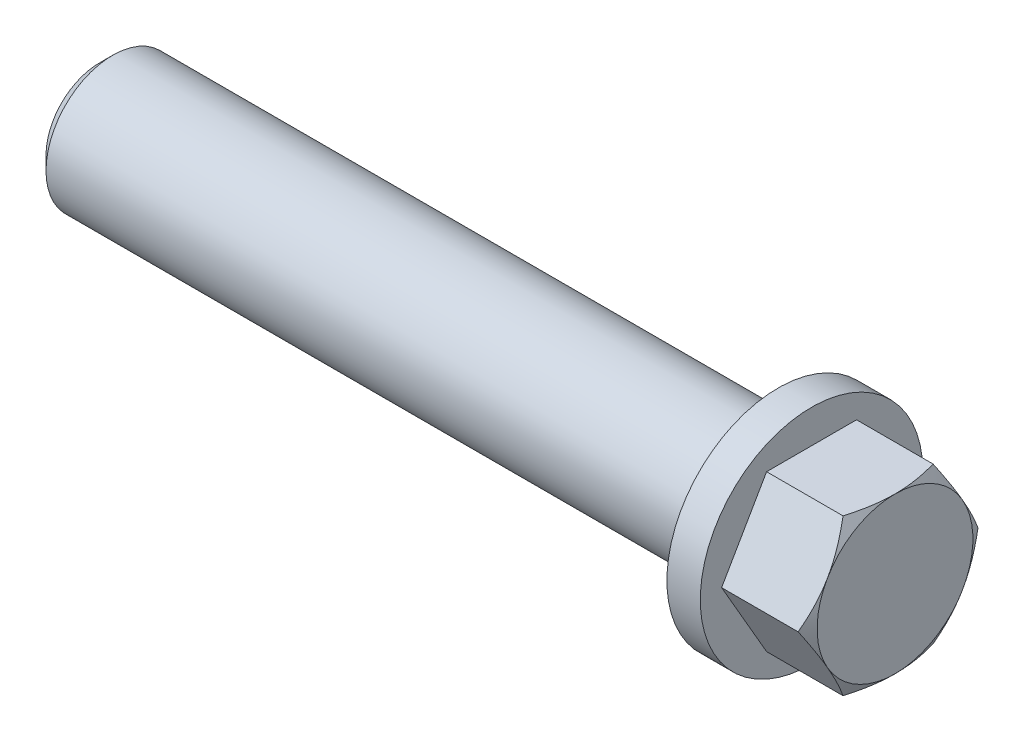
ISO-10303-21;
HEADER;
FILE_DESCRIPTION(('STEP AP214'),'2;1');
FILE_NAME('part.step','',(''),(''),'','','');
FILE_SCHEMA(('AUTOMOTIVE_DESIGN { 1 0 10303 214 1 1 1 1 }'));
ENDSEC;
DATA;
#1=APPLICATION_CONTEXT('core data for automotive mechanical design processes');
#2=APPLICATION_PROTOCOL_DEFINITION('international standard','automotive_design',2000,#1);
#3=PRODUCT_CONTEXT('',#1,'mechanical');
#4=PRODUCT('Part','Part','',(#3));
#5=PRODUCT_RELATED_PRODUCT_CATEGORY('part','',(#4));
#6=PRODUCT_DEFINITION_FORMATION('','',#4);
#7=PRODUCT_DEFINITION_CONTEXT('part definition',#1,'design');
#8=PRODUCT_DEFINITION('design','',#6,#7);
#9=PRODUCT_DEFINITION_SHAPE('','',#8);
#10=(LENGTH_UNIT() NAMED_UNIT(*) SI_UNIT(.MILLI.,.METRE.));
#11=(NAMED_UNIT(*) PLANE_ANGLE_UNIT() SI_UNIT($,.RADIAN.));
#12=(NAMED_UNIT(*) SI_UNIT($,.STERADIAN.) SOLID_ANGLE_UNIT());
#13=UNCERTAINTY_MEASURE_WITH_UNIT(LENGTH_MEASURE(1.E-05),#10,'distance_accuracy_value','');
#14=(GEOMETRIC_REPRESENTATION_CONTEXT(3) GLOBAL_UNCERTAINTY_ASSIGNED_CONTEXT((#13)) GLOBAL_UNIT_ASSIGNED_CONTEXT((#10,
#11,#12)) REPRESENTATION_CONTEXT('',''));
#15=CARTESIAN_POINT('',(0.,0.,0.));
#16=DIRECTION('',(0.,0.,1.));
#17=DIRECTION('',(1.,0.,0.));
#18=AXIS2_PLACEMENT_3D('',#15,#16,#17);
#19=CARTESIAN_POINT('',(7.5,-7.,-4.04145188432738));
#20=DIRECTION('',(0.,0.5,0.866025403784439));
#21=DIRECTION('',(0.,-0.866025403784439,0.5));
#22=AXIS2_PLACEMENT_3D('',#19,#20,#21);
#23=PLANE('',#22);
#24=DIRECTION('',(-1.,0.,0.));
#25=VECTOR('',#24,1.);
#26=CARTESIAN_POINT('',(7.5,0.,-8.08290376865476));
#27=LINE('',#26,#25);
#28=CARTESIAN_POINT('',(6.87478521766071,0.,-8.08290376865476));
#29=VERTEX_POINT('',#28);
#30=CARTESIAN_POINT('',(0.,0.,-8.08290376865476));
#31=VERTEX_POINT('',#30);
#32=EDGE_CURVE('E145',#29,#31,#27,.T.);
#33=ORIENTED_EDGE('',*,*,#32,.F.);
#34=CARTESIAN_POINT('',(6.8747185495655,0.0002,-8.0830192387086));
#35=CARTESIAN_POINT('',(6.92600015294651,-0.153667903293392,-7.99418356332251));
#36=CARTESIAN_POINT('',(6.97495440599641,-0.308109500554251,-7.90501666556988));
#37=CARTESIAN_POINT('',(7.06756721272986,-0.618246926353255,-7.72595873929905));
#38=CARTESIAN_POINT('',(7.11122348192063,-0.773943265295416,-7.63606741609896));
#39=CARTESIAN_POINT('',(7.2333884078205,-1.24352516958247,-7.36495417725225));
#40=CARTESIAN_POINT('',(7.30287444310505,-1.5592643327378,-7.18266208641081));
#41=CARTESIAN_POINT('',(7.3843550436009,-2.03176224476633,-6.9098652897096));
#42=CARTESIAN_POINT('',(7.40756651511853,-2.18710922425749,-6.82017566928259));
#43=CARTESIAN_POINT('',(7.44648878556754,-2.49850511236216,-6.64039116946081));
#44=CARTESIAN_POINT('',(7.46220024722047,-2.65455395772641,-6.55029632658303));
#45=CARTESIAN_POINT('',(7.48572208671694,-2.96692267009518,-6.36995016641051));
#46=CARTESIAN_POINT('',(7.49354143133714,-3.12324202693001,-6.27969914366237));
#47=CARTESIAN_POINT('',(7.50111975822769,-3.43601650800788,-6.09911871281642));
#48=CARTESIAN_POINT('',(7.50087898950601,-3.59247162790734,-6.00878930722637));
#49=CARTESIAN_POINT('',(7.4891402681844,-4.02110687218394,-5.76131663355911));
#50=CARTESIAN_POINT('',(7.46943425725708,-4.2931466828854,-5.60425437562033));
#51=CARTESIAN_POINT('',(7.40694653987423,-4.8354194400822,-5.29117305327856));
#52=CARTESIAN_POINT('',(7.36414347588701,-5.10565047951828,-5.13515508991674));
#53=CARTESIAN_POINT('',(7.25714832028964,-5.64901454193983,-4.82144370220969));
#54=CARTESIAN_POINT('',(7.19250290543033,-5.92207900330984,-4.66378986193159));
#55=CARTESIAN_POINT('',(7.04578392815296,-6.46413578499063,-4.35083323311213));
#56=CARTESIAN_POINT('',(6.96374482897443,-6.73313504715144,-4.19552643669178));
#57=CARTESIAN_POINT('',(6.8747185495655,-7.0002,-4.04133641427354));
#58=B_SPLINE_CURVE_WITH_KNOTS('',3,(#34,#35,#36,#37,#38,#39,#40,#41,#42,#43,#44,#45,#46,#47,#48,
#49,#50,#51,#52,#53,#54,#55,#56,#57),.UNSPECIFIED.,.F.,.F.,(4,2,2,2,2,2,2,2,2,2,2,4),(0.,
0.554727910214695,1.10969417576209,2.2219327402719,2.76443041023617,3.30688013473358,
3.8487128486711,4.39052882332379,5.33376515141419,6.27787517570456,7.2429241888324,
8.20607866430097),.UNSPECIFIED.);
#59=CARTESIAN_POINT('',(7.5,-3.5,-6.06217782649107));
#60=VERTEX_POINT('',#59);
#61=EDGE_CURVE('E228',#29,#60,#58,.T.);
#62=ORIENTED_EDGE('',*,*,#61,.T.);
#63=CARTESIAN_POINT('',(6.87478521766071,-7.,-4.04145188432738));
#64=VERTEX_POINT('',#63);
#65=EDGE_CURVE('E230',#60,#64,#58,.T.);
#66=ORIENTED_EDGE('',*,*,#65,.T.);
#67=DIRECTION('',(-1.,0.,0.));
#68=VECTOR('',#67,1.);
#69=CARTESIAN_POINT('',(7.5,-7.,-4.04145188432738));
#70=LINE('',#69,#68);
#71=CARTESIAN_POINT('',(0.,-7.,-4.04145188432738));
#72=VERTEX_POINT('',#71);
#73=EDGE_CURVE('E117',#64,#72,#70,.T.);
#74=ORIENTED_EDGE('',*,*,#73,.T.);
#75=DIRECTION('',(0.,0.866025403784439,-0.5));
#76=VECTOR('',#75,1.);
#77=CARTESIAN_POINT('',(0.,-7.,-4.04145188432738));
#78=LINE('',#77,#76);
#79=EDGE_CURVE('E113',#72,#31,#78,.T.);
#80=ORIENTED_EDGE('',*,*,#79,.T.);
#81=EDGE_LOOP('',(#33,#62,#66,#74,#80));
#82=FACE_BOUND('',#81,.T.);
#83=ADVANCED_FACE('F36',(#82),#23,.F.);
#84=CARTESIAN_POINT('',(7.5,0.,-8.08290376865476));
#85=DIRECTION('',(0.,-0.5,0.866025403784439));
#86=DIRECTION('',(0.,-0.866025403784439,-0.5));
#87=AXIS2_PLACEMENT_3D('',#84,#85,#86);
#88=PLANE('',#87);
#89=DIRECTION('',(-1.,0.,0.));
#90=VECTOR('',#89,1.);
#91=CARTESIAN_POINT('',(7.5,7.,-4.04145188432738));
#92=LINE('',#91,#90);
#93=CARTESIAN_POINT('',(6.87478521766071,7.,-4.04145188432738));
#94=VERTEX_POINT('',#93);
#95=CARTESIAN_POINT('',(0.,7.,-4.04145188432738));
#96=VERTEX_POINT('',#95);
#97=EDGE_CURVE('E142',#94,#96,#92,.T.);
#98=ORIENTED_EDGE('',*,*,#97,.F.);
#99=CARTESIAN_POINT('',(6.8747185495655,7.0002,-4.04133641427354));
#100=CARTESIAN_POINT('',(6.92600015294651,6.84633209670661,-4.13017208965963));
#101=CARTESIAN_POINT('',(6.97495440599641,6.69189049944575,-4.21933898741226));
#102=CARTESIAN_POINT('',(7.06756721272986,6.38175307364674,-4.39839691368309));
#103=CARTESIAN_POINT('',(7.11122348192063,6.22605673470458,-4.48828823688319));
#104=CARTESIAN_POINT('',(7.2333884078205,5.75647483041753,-4.75940147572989));
#105=CARTESIAN_POINT('',(7.30287444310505,5.4407356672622,-4.94169356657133));
#106=CARTESIAN_POINT('',(7.3843550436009,4.96823775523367,-5.21449036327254));
#107=CARTESIAN_POINT('',(7.40756651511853,4.81289077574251,-5.30417998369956));
#108=CARTESIAN_POINT('',(7.44648878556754,4.50149488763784,-5.48396448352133));
#109=CARTESIAN_POINT('',(7.46220024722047,4.34544604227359,-5.57405932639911));
#110=CARTESIAN_POINT('',(7.48572208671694,4.03307732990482,-5.75440548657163));
#111=CARTESIAN_POINT('',(7.49354143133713,3.87675797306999,-5.84465650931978));
#112=CARTESIAN_POINT('',(7.50111975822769,3.56398349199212,-6.02523694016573));
#113=CARTESIAN_POINT('',(7.50087898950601,3.40752837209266,-6.11556634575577));
#114=CARTESIAN_POINT('',(7.4891402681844,2.97889312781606,-6.36303901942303));
#115=CARTESIAN_POINT('',(7.46943425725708,2.7068533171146,-6.52010127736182));
#116=CARTESIAN_POINT('',(7.40694653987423,2.1645805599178,-6.83318259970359));
#117=CARTESIAN_POINT('',(7.36414347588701,1.89434952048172,-6.9892005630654));
#118=CARTESIAN_POINT('',(7.25714832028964,1.35098545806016,-7.30291195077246));
#119=CARTESIAN_POINT('',(7.19250290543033,1.07792099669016,-7.46056579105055));
#120=CARTESIAN_POINT('',(7.04578392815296,0.535864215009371,-7.77352241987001));
#121=CARTESIAN_POINT('',(6.96374482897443,0.26686495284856,-7.92882921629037));
#122=CARTESIAN_POINT('',(6.8747185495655,-0.000200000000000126,-8.0830192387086));
#123=B_SPLINE_CURVE_WITH_KNOTS('',3,(#99,#100,#101,#102,#103,#104,#105,#106,#107,#108,#109,#110,
#111,#112,#113,#114,#115,#116,#117,#118,#119,#120,#121,#122),.UNSPECIFIED.,.F.,.F.,(4,2,2,2,2,2,
2,2,2,2,2,4),(0.,0.554727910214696,1.10969417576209,2.2219327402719,2.76443041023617,
3.30688013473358,3.8487128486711,4.39052882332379,5.33376515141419,6.27787517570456,
7.2429241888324,8.20607866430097),.UNSPECIFIED.);
#124=CARTESIAN_POINT('',(7.5,3.5,-6.06217782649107));
#125=VERTEX_POINT('',#124);
#126=EDGE_CURVE('E219',#94,#125,#123,.T.);
#127=ORIENTED_EDGE('',*,*,#126,.T.);
#128=EDGE_CURVE('E193',#125,#29,#123,.T.);
#129=ORIENTED_EDGE('',*,*,#128,.T.);
#130=ORIENTED_EDGE('',*,*,#32,.T.);
#131=DIRECTION('',(0.,0.866025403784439,0.5));
#132=VECTOR('',#131,1.);
#133=CARTESIAN_POINT('',(0.,0.,-8.08290376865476));
#134=LINE('',#133,#132);
#135=EDGE_CURVE('E184',#31,#96,#134,.T.);
#136=ORIENTED_EDGE('',*,*,#135,.T.);
#137=EDGE_LOOP('',(#98,#127,#129,#130,#136));
#138=FACE_BOUND('',#137,.T.);
#139=ADVANCED_FACE('F207',(#138),#88,.F.);
#140=CARTESIAN_POINT('',(7.5,7.,-4.04145188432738));
#141=DIRECTION('',(0.,-1.,0.));
#142=DIRECTION('',(0.,0.,-1.));
#143=AXIS2_PLACEMENT_3D('',#140,#141,#142);
#144=PLANE('',#143);
#145=DIRECTION('',(-1.,0.,0.));
#146=VECTOR('',#145,1.);
#147=CARTESIAN_POINT('',(7.5,6.99999999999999,4.04145188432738));
#148=LINE('',#147,#146);
#149=CARTESIAN_POINT('',(6.87478521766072,6.99999999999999,4.04145188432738));
#150=VERTEX_POINT('',#149);
#151=CARTESIAN_POINT('',(0.,6.99999999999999,4.04145188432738));
#152=VERTEX_POINT('',#151);
#153=EDGE_CURVE('E139',#150,#152,#148,.T.);
#154=ORIENTED_EDGE('',*,*,#153,.F.);
#155=CARTESIAN_POINT('',(4.06584479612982,7.00000000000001,-10.8928464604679));
#156=CARTESIAN_POINT('',(4.21450026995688,7.00000000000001,-10.5867029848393));
#157=CARTESIAN_POINT('',(4.36174066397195,7.,-10.2798605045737));
#158=CARTESIAN_POINT('',(4.65259582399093,7.,-9.66440574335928));
#159=CARTESIAN_POINT('',(4.79621002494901,7.,-9.35579319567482));
#160=CARTESIAN_POINT('',(5.07973140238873,7.,-8.73485529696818));
#161=CARTESIAN_POINT('',(5.21961447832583,7.,-8.4225189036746));
#162=CARTESIAN_POINT('',(5.49370236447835,7.,-7.7953737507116));
#163=CARTESIAN_POINT('',(5.62790744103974,7.,-7.48056510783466));
#164=CARTESIAN_POINT('',(5.89331373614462,7.,-6.8378693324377));
#165=CARTESIAN_POINT('',(6.0242822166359,7.,-6.50988555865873));
#166=CARTESIAN_POINT('',(6.27639631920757,7.,-5.85009595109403));
#167=CARTESIAN_POINT('',(6.39754084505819,7.,-5.51828969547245));
#168=CARTESIAN_POINT('',(6.62685500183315,7.,-4.85093135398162));
#169=CARTESIAN_POINT('',(6.73505052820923,7.,-4.51538826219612));
#170=CARTESIAN_POINT('',(6.93502168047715,7.,-3.83950215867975));
#171=CARTESIAN_POINT('',(7.02680243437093,7.,-3.49916068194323));
#172=CARTESIAN_POINT('',(7.1890943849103,7.,-2.81522305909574));
#173=CARTESIAN_POINT('',(7.25971625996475,7.,-2.47165390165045));
#174=CARTESIAN_POINT('',(7.34671847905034,7.,-1.95314285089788));
#175=CARTESIAN_POINT('',(7.37256524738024,7.,-1.77976757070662));
#176=CARTESIAN_POINT('',(7.41744250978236,7.,-1.43214350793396));
#177=CARTESIAN_POINT('',(7.436473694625,7.,-1.25789481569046));
#178=CARTESIAN_POINT('',(7.467100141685,7.,-0.911049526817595));
#179=CARTESIAN_POINT('',(7.47878980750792,7.,-0.738461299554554));
#180=CARTESIAN_POINT('',(7.49485833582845,7.,-0.392945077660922));
#181=CARTESIAN_POINT('',(7.49923732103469,7.,-0.220017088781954));
#182=CARTESIAN_POINT('',(7.50057992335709,7.,0.125872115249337));
#183=CARTESIAN_POINT('',(7.49754340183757,7.,0.2988333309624));
#184=CARTESIAN_POINT('',(7.48412945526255,7.,0.644473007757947));
#185=CARTESIAN_POINT('',(7.47375167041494,7.,0.817151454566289));
#186=CARTESIAN_POINT('',(7.44031338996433,7.,1.23087218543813));
#187=CARTESIAN_POINT('',(7.41384108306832,7.,1.47164462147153));
#188=CARTESIAN_POINT('',(7.34805815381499,7.,1.9514167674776));
#189=CARTESIAN_POINT('',(7.30874582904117,6.99999999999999,2.19041623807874));
#190=CARTESIAN_POINT('',(7.17363274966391,6.99999999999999,2.90445905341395));
#191=CARTESIAN_POINT('',(7.06067846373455,6.99999999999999,3.37630026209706));
#192=CARTESIAN_POINT('',(6.86454385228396,6.99999999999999,4.0821986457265));
#193=CARTESIAN_POINT('',(6.79374157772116,6.99999999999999,4.31990513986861));
#194=CARTESIAN_POINT('',(6.64473048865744,6.99999999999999,4.7930081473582));
#195=CARTESIAN_POINT('',(6.5665216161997,6.99999999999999,5.02840464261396));
#196=CARTESIAN_POINT('',(6.40395697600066,6.99999999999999,5.49696607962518));
#197=CARTESIAN_POINT('',(6.31960307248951,6.99999999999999,5.73013167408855));
#198=CARTESIAN_POINT('',(6.14574648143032,6.99999999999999,6.19452230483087));
#199=CARTESIAN_POINT('',(6.05624392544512,6.99999999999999,6.42574739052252));
#200=CARTESIAN_POINT('',(5.79939160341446,6.99999999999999,7.0713958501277));
#201=CARTESIAN_POINT('',(5.62721890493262,6.99999999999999,7.4838990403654));
#202=CARTESIAN_POINT('',(5.272711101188,6.99999999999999,8.30453182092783));
#203=CARTESIAN_POINT('',(5.09037475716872,6.99999999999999,8.71266087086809));
#204=CARTESIAN_POINT('',(4.71806030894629,6.99999999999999,9.52561092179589));
#205=CARTESIAN_POINT('',(4.52807907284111,6.99999999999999,9.93043048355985));
#206=CARTESIAN_POINT('',(4.14238756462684,6.99999999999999,10.7372987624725));
#207=CARTESIAN_POINT('',(3.94667755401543,6.99999999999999,11.1393476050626));
#208=CARTESIAN_POINT('',(3.55049419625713,6.99999999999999,11.9419246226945));
#209=CARTESIAN_POINT('',(3.35001341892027,6.99999999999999,12.3424491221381));
#210=CARTESIAN_POINT('',(2.94555879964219,6.99999999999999,13.1417322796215));
#211=CARTESIAN_POINT('',(2.7415849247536,6.99999999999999,13.540490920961));
#212=CARTESIAN_POINT('',(2.33090289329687,6.99999999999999,14.3364753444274));
#213=CARTESIAN_POINT('',(2.1241954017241,6.99999999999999,14.7337014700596));
#214=CARTESIAN_POINT('',(1.70852695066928,6.99999999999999,15.526973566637));
#215=CARTESIAN_POINT('',(1.4995659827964,6.99999999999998,15.9230195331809));
#216=CARTESIAN_POINT('',(0.916803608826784,6.99999999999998,17.0213557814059));
#217=CARTESIAN_POINT('',(0.541023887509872,6.99999999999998,17.7225961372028));
#218=CARTESIAN_POINT('',(-0.214721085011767,6.99999999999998,19.1228739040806));
#219=CARTESIAN_POINT('',(-0.594686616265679,6.99999999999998,19.821911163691));
#220=CARTESIAN_POINT('',(-1.35641145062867,6.99999999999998,21.2159219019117));
#221=CARTESIAN_POINT('',(-1.73816026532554,6.99999999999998,21.9109011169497));
#222=CARTESIAN_POINT('',(-2.50401122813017,6.99999999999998,23.2994872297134));
#223=CARTESIAN_POINT('',(-2.8881131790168,6.99999999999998,23.9930942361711));
#224=CARTESIAN_POINT('',(-3.27306517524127,6.99999999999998,24.6862258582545));
#225=B_SPLINE_CURVE_WITH_KNOTS('',3,(#155,#156,#157,#158,#159,#160,#161,#162,#163,#164,#165,
#166,#167,#168,#169,#170,#171,#172,#173,#174,#175,#176,#177,#178,#179,#180,#181,#182,#183,#184,
#185,#186,#187,#188,#189,#190,#191,#192,#193,#194,#195,#196,#197,#198,#199,#200,#201,#202,#203,
#204,#205,#206,#207,#208,#209,#210,#211,#212,#213,#214,#215,#216,#217,#218,#219,#220,#221,#222,
#223,#224),.UNSPECIFIED.,.F.,.F.,(4,2,2,2,2,2,2,2,2,2,2,2,2,2,2,2,2,2,2,2,2,2,2,2,2,2,2,2,2,2,2,
2,2,2,4),(0.,1.02099246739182,2.04214305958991,3.06878742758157,4.09538358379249,
5.15475890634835,6.21425227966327,7.27159015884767,8.32859714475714,9.37997449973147,
9.90573557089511,10.4314433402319,10.9502447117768,11.469037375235,11.9878397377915,
12.5066675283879,13.2329284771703,13.9592857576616,15.4127396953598,16.1567571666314,
16.9007804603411,17.6445789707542,18.3883584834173,19.7291255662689,21.070056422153,
22.4115423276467,23.7529670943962,25.0966389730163,26.4403235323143,27.7836870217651,
29.1270555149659,31.5137750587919,33.9006552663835,36.2794216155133,38.6579912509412),.UNSPECIFIED.);
#226=CARTESIAN_POINT('',(7.5,7.,0.));
#227=VERTEX_POINT('',#226);
#228=EDGE_CURVE('E176',#150,#227,#225,.F.);
#229=ORIENTED_EDGE('',*,*,#228,.T.);
#230=EDGE_CURVE('E178',#227,#94,#225,.F.);
#231=ORIENTED_EDGE('',*,*,#230,.T.);
#232=ORIENTED_EDGE('',*,*,#97,.T.);
#233=DIRECTION('',(0.,0.,1.));
#234=VECTOR('',#233,1.);
#235=CARTESIAN_POINT('',(0.,7.,-4.04145188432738));
#236=LINE('',#235,#234);
#237=EDGE_CURVE('E133',#96,#152,#236,.T.);
#238=ORIENTED_EDGE('',*,*,#237,.T.);
#239=EDGE_LOOP('',(#154,#229,#231,#232,#238));
#240=FACE_BOUND('',#239,.T.);
#241=ADVANCED_FACE('F177',(#240),#144,.F.);
#242=CARTESIAN_POINT('',(7.5,6.99999999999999,4.04145188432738));
#243=DIRECTION('',(0.,-0.5,-0.866025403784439));
#244=DIRECTION('',(0.,0.866025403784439,-0.5));
#245=AXIS2_PLACEMENT_3D('',#242,#243,#244);
#246=PLANE('',#245);
#247=DIRECTION('',(-1.,0.,0.));
#248=VECTOR('',#247,1.);
#249=CARTESIAN_POINT('',(7.5,0.,8.08290376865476));
#250=LINE('',#249,#248);
#251=CARTESIAN_POINT('',(6.87478521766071,0.,8.08290376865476));
#252=VERTEX_POINT('',#251);
#253=CARTESIAN_POINT('',(0.,0.,8.08290376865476));
#254=VERTEX_POINT('',#253);
#255=EDGE_CURVE('E125',#252,#254,#250,.T.);
#256=ORIENTED_EDGE('',*,*,#255,.F.);
#257=CARTESIAN_POINT('',(6.8747185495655,-0.000200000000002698,8.0830192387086));
#258=CARTESIAN_POINT('',(6.92600015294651,0.153667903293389,7.99418356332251));
#259=CARTESIAN_POINT('',(6.97495440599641,0.308109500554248,7.90501666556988));
#260=CARTESIAN_POINT('',(7.06756721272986,0.618246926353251,7.72595873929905));
#261=CARTESIAN_POINT('',(7.11122348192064,0.773943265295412,7.63606741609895));
#262=CARTESIAN_POINT('',(7.23338840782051,1.24352516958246,7.36495417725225));
#263=CARTESIAN_POINT('',(7.30287444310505,1.5592643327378,7.18266208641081));
#264=CARTESIAN_POINT('',(7.3843550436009,2.03176224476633,6.9098652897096));
#265=CARTESIAN_POINT('',(7.40756651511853,2.18710922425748,6.82017566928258));
#266=CARTESIAN_POINT('',(7.44648878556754,2.49850511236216,6.64039116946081));
#267=CARTESIAN_POINT('',(7.46220024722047,2.65455395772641,6.55029632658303));
#268=CARTESIAN_POINT('',(7.48572208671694,2.96692267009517,6.36995016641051));
#269=CARTESIAN_POINT('',(7.49354143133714,3.12324202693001,6.27969914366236));
#270=CARTESIAN_POINT('',(7.5011197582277,3.43601650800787,6.09911871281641));
#271=CARTESIAN_POINT('',(7.50087898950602,3.59247162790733,6.00878930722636));
#272=CARTESIAN_POINT('',(7.4891402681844,4.02110687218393,5.76131663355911));
#273=CARTESIAN_POINT('',(7.46943425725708,4.2931466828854,5.60425437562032));
#274=CARTESIAN_POINT('',(7.40694653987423,4.83541944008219,5.29117305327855));
#275=CARTESIAN_POINT('',(7.36414347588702,5.10565047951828,5.13515508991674));
#276=CARTESIAN_POINT('',(7.25714832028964,5.64901454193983,4.82144370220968));
#277=CARTESIAN_POINT('',(7.19250290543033,5.92207900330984,4.66378986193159));
#278=CARTESIAN_POINT('',(7.04578392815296,6.46413578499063,4.35083323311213));
#279=CARTESIAN_POINT('',(6.96374482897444,6.73313504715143,4.19552643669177));
#280=CARTESIAN_POINT('',(6.8747185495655,7.00019999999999,4.04133641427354));
#281=B_SPLINE_CURVE_WITH_KNOTS('',3,(#257,#258,#259,#260,#261,#262,#263,#264,#265,#266,#267,
#268,#269,#270,#271,#272,#273,#274,#275,#276,#277,#278,#279,#280),.UNSPECIFIED.,.F.,.F.,(4,2,2,
2,2,2,2,2,2,2,2,4),(0.,0.554727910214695,1.10969417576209,2.2219327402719,2.76443041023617,
3.30688013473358,3.8487128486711,4.39052882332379,5.33376515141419,6.27787517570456,
7.2429241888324,8.20607866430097),.UNSPECIFIED.);
#282=CARTESIAN_POINT('',(7.5,3.5,6.06217782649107));
#283=VERTEX_POINT('',#282);
#284=EDGE_CURVE('E221',#252,#283,#281,.T.);
#285=ORIENTED_EDGE('',*,*,#284,.T.);
#286=EDGE_CURVE('E186',#283,#150,#281,.T.);
#287=ORIENTED_EDGE('',*,*,#286,.T.);
#288=ORIENTED_EDGE('',*,*,#153,.T.);
#289=DIRECTION('',(0.,-0.866025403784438,0.5));
#290=VECTOR('',#289,1.);
#291=CARTESIAN_POINT('',(0.,6.99999999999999,4.04145188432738));
#292=LINE('',#291,#290);
#293=EDGE_CURVE('E131',#152,#254,#292,.T.);
#294=ORIENTED_EDGE('',*,*,#293,.T.);
#295=EDGE_LOOP('',(#256,#285,#287,#288,#294));
#296=FACE_BOUND('',#295,.T.);
#297=ADVANCED_FACE('F206',(#296),#246,.F.);
#298=CARTESIAN_POINT('',(7.5,0.,8.08290376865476));
#299=DIRECTION('',(0.,0.5,-0.866025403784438));
#300=DIRECTION('',(0.,0.866025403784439,0.5));
#301=AXIS2_PLACEMENT_3D('',#298,#299,#300);
#302=PLANE('',#301);
#303=DIRECTION('',(-1.,0.,0.));
#304=VECTOR('',#303,1.);
#305=CARTESIAN_POINT('',(7.5,-7.,4.04145188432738));
#306=LINE('',#305,#304);
#307=CARTESIAN_POINT('',(6.87478521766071,-7.,4.04145188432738));
#308=VERTEX_POINT('',#307);
#309=CARTESIAN_POINT('',(0.,-7.,4.04145188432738));
#310=VERTEX_POINT('',#309);
#311=EDGE_CURVE('E120',#308,#310,#306,.T.);
#312=ORIENTED_EDGE('',*,*,#311,.F.);
#313=CARTESIAN_POINT('',(6.8747185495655,-7.0002,4.04133641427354));
#314=CARTESIAN_POINT('',(6.92600015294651,-6.84633209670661,4.13017208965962));
#315=CARTESIAN_POINT('',(6.97495440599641,-6.69189049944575,4.21933898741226));
#316=CARTESIAN_POINT('',(7.06756721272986,-6.38175307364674,4.39839691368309));
#317=CARTESIAN_POINT('',(7.11122348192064,-6.22605673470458,4.48828823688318));
#318=CARTESIAN_POINT('',(7.2333884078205,-5.75647483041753,4.75940147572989));
#319=CARTESIAN_POINT('',(7.30287444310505,-5.4407356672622,4.94169356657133));
#320=CARTESIAN_POINT('',(7.3843550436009,-4.96823775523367,5.21449036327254));
#321=CARTESIAN_POINT('',(7.40756651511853,-4.81289077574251,5.30417998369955));
#322=CARTESIAN_POINT('',(7.44648878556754,-4.50149488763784,5.48396448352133));
#323=CARTESIAN_POINT('',(7.46220024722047,-4.34544604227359,5.57405932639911));
#324=CARTESIAN_POINT('',(7.48572208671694,-4.03307732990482,5.75440548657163));
#325=CARTESIAN_POINT('',(7.49354143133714,-3.87675797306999,5.84465650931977));
#326=CARTESIAN_POINT('',(7.50111975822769,-3.56398349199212,6.02523694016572));
#327=CARTESIAN_POINT('',(7.50087898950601,-3.40752837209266,6.11556634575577));
#328=CARTESIAN_POINT('',(7.4891402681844,-2.97889312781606,6.36303901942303));
#329=CARTESIAN_POINT('',(7.46943425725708,-2.7068533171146,6.52010127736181));
#330=CARTESIAN_POINT('',(7.40694653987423,-2.1645805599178,6.83318259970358));
#331=CARTESIAN_POINT('',(7.36414347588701,-1.89434952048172,6.9892005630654));
#332=CARTESIAN_POINT('',(7.25714832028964,-1.35098545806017,7.30291195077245));
#333=CARTESIAN_POINT('',(7.19250290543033,-1.07792099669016,7.46056579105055));
#334=CARTESIAN_POINT('',(7.04578392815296,-0.535864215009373,7.77352241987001));
#335=CARTESIAN_POINT('',(6.96374482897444,-0.266864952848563,7.92882921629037));
#336=CARTESIAN_POINT('',(6.8747185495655,0.000199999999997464,8.0830192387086));
#337=B_SPLINE_CURVE_WITH_KNOTS('',3,(#313,#314,#315,#316,#317,#318,#319,#320,#321,#322,#323,
#324,#325,#326,#327,#328,#329,#330,#331,#332,#333,#334,#335,#336),.UNSPECIFIED.,.F.,.F.,(4,2,2,
2,2,2,2,2,2,2,2,4),(0.,0.554727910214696,1.10969417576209,2.2219327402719,2.76443041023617,
3.30688013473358,3.8487128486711,4.39052882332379,5.33376515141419,6.27787517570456,
7.2429241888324,8.20607866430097),.UNSPECIFIED.);
#338=CARTESIAN_POINT('',(7.5,-3.5,6.06217782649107));
#339=VERTEX_POINT('',#338);
#340=EDGE_CURVE('E56',#308,#339,#337,.T.);
#341=ORIENTED_EDGE('',*,*,#340,.T.);
#342=EDGE_CURVE('E227',#339,#252,#337,.T.);
#343=ORIENTED_EDGE('',*,*,#342,.T.);
#344=ORIENTED_EDGE('',*,*,#255,.T.);
#345=DIRECTION('',(0.,-0.866025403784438,-0.5));
#346=VECTOR('',#345,1.);
#347=CARTESIAN_POINT('',(0.,0.,8.08290376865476));
#348=LINE('',#347,#346);
#349=EDGE_CURVE('E110',#254,#310,#348,.T.);
#350=ORIENTED_EDGE('',*,*,#349,.T.);
#351=EDGE_LOOP('',(#312,#341,#343,#344,#350));
#352=FACE_BOUND('',#351,.T.);
#353=ADVANCED_FACE('F127',(#352),#302,.F.);
#354=CARTESIAN_POINT('',(7.5,-7.,4.04145188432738));
#355=DIRECTION('',(0.,1.,0.));
#356=DIRECTION('',(0.,0.,1.));
#357=AXIS2_PLACEMENT_3D('',#354,#355,#356);
#358=PLANE('',#357);
#359=ORIENTED_EDGE('',*,*,#73,.F.);
#360=CARTESIAN_POINT('',(4.06584479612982,-7.,-10.8928464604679));
#361=CARTESIAN_POINT('',(4.21450026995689,-7.,-10.5867029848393));
#362=CARTESIAN_POINT('',(4.36174066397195,-7.,-10.2798605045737));
#363=CARTESIAN_POINT('',(4.65259582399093,-7.,-9.66440574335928));
#364=CARTESIAN_POINT('',(4.79621002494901,-7.,-9.35579319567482));
#365=CARTESIAN_POINT('',(5.07973140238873,-7.,-8.73485529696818));
#366=CARTESIAN_POINT('',(5.21961447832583,-7.,-8.4225189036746));
#367=CARTESIAN_POINT('',(5.49370236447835,-7.,-7.7953737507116));
#368=CARTESIAN_POINT('',(5.62790744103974,-7.,-7.48056510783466));
#369=CARTESIAN_POINT('',(5.89331373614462,-7.,-6.8378693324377));
#370=CARTESIAN_POINT('',(6.0242822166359,-7.,-6.50988555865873));
#371=CARTESIAN_POINT('',(6.27639631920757,-7.,-5.85009595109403));
#372=CARTESIAN_POINT('',(6.39754084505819,-7.,-5.51828969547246));
#373=CARTESIAN_POINT('',(6.62685500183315,-7.,-4.85093135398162));
#374=CARTESIAN_POINT('',(6.73505052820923,-7.,-4.51538826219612));
#375=CARTESIAN_POINT('',(6.93502168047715,-7.,-3.83950215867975));
#376=CARTESIAN_POINT('',(7.02680243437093,-7.,-3.49916068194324));
#377=CARTESIAN_POINT('',(7.1890943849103,-7.,-2.81522305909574));
#378=CARTESIAN_POINT('',(7.25971625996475,-7.,-2.47165390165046));
#379=CARTESIAN_POINT('',(7.34671847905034,-7.,-1.95314285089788));
#380=CARTESIAN_POINT('',(7.37256524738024,-7.,-1.77976757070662));
#381=CARTESIAN_POINT('',(7.41744250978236,-7.,-1.43214350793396));
#382=CARTESIAN_POINT('',(7.436473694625,-7.,-1.25789481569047));
#383=CARTESIAN_POINT('',(7.467100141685,-7.,-0.911049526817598));
#384=CARTESIAN_POINT('',(7.47878980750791,-7.,-0.738461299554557));
#385=CARTESIAN_POINT('',(7.49485833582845,-7.,-0.392945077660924));
#386=CARTESIAN_POINT('',(7.49923732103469,-7.,-0.220017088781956));
#387=CARTESIAN_POINT('',(7.50057992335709,-7.,0.125872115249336));
#388=CARTESIAN_POINT('',(7.49754340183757,-7.,0.2988333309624));
#389=CARTESIAN_POINT('',(7.48412945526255,-7.,0.644473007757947));
#390=CARTESIAN_POINT('',(7.47375167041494,-7.,0.81715145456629));
#391=CARTESIAN_POINT('',(7.44031338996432,-7.,1.23087218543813));
#392=CARTESIAN_POINT('',(7.41384108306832,-7.,1.47164462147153));
#393=CARTESIAN_POINT('',(7.34805815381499,-7.,1.9514167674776));
#394=CARTESIAN_POINT('',(7.30874582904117,-7.,2.19041623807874));
#395=CARTESIAN_POINT('',(7.17363274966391,-7.,2.90445905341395));
#396=CARTESIAN_POINT('',(7.06067846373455,-7.,3.37630026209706));
#397=CARTESIAN_POINT('',(6.86454385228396,-7.,4.0821986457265));
#398=CARTESIAN_POINT('',(6.79374157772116,-7.,4.31990513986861));
#399=CARTESIAN_POINT('',(6.64473048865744,-7.,4.7930081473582));
#400=CARTESIAN_POINT('',(6.56652161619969,-7.,5.02840464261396));
#401=CARTESIAN_POINT('',(6.40395697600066,-7.,5.49696607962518));
#402=CARTESIAN_POINT('',(6.3196030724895,-7.,5.73013167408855));
#403=CARTESIAN_POINT('',(6.14574648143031,-7.,6.19452230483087));
#404=CARTESIAN_POINT('',(6.05624392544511,-7.,6.42574739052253));
#405=CARTESIAN_POINT('',(5.79939160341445,-7.,7.07139585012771));
#406=CARTESIAN_POINT('',(5.62721890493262,-7.,7.4838990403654));
#407=CARTESIAN_POINT('',(5.27271110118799,-7.,8.30453182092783));
#408=CARTESIAN_POINT('',(5.09037475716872,-7.,8.71266087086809));
#409=CARTESIAN_POINT('',(4.71806030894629,-7.,9.52561092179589));
#410=CARTESIAN_POINT('',(4.5280790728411,-7.,9.93043048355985));
#411=CARTESIAN_POINT('',(4.14238756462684,-7.,10.7372987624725));
#412=CARTESIAN_POINT('',(3.94667755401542,-7.,11.1393476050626));
#413=CARTESIAN_POINT('',(3.55049419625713,-7.,11.9419246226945));
#414=CARTESIAN_POINT('',(3.35001341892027,-7.,12.3424491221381));
#415=CARTESIAN_POINT('',(2.94555879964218,-7.,13.1417322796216));
#416=CARTESIAN_POINT('',(2.7415849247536,-7.,13.540490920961));
#417=CARTESIAN_POINT('',(2.33090289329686,-7.,14.3364753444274));
#418=CARTESIAN_POINT('',(2.12419540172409,-7.,14.7337014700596));
#419=CARTESIAN_POINT('',(1.70852695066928,-7.,15.526973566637));
#420=CARTESIAN_POINT('',(1.4995659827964,-7.,15.9230195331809));
#421=CARTESIAN_POINT('',(0.91680360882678,-7.,17.0213557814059));
#422=CARTESIAN_POINT('',(0.541023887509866,-7.,17.7225961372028));
#423=CARTESIAN_POINT('',(-0.214721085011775,-7.,19.1228739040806));
#424=CARTESIAN_POINT('',(-0.594686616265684,-7.,19.821911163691));
#425=CARTESIAN_POINT('',(-1.35641145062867,-7.,21.2159219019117));
#426=CARTESIAN_POINT('',(-1.73816026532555,-7.,21.9109011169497));
#427=CARTESIAN_POINT('',(-2.50401122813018,-7.,23.2994872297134));
#428=CARTESIAN_POINT('',(-2.88811317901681,-7.,23.9930942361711));
#429=CARTESIAN_POINT('',(-3.27306517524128,-7.,24.6862258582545));
#430=B_SPLINE_CURVE_WITH_KNOTS('',3,(#360,#361,#362,#363,#364,#365,#366,#367,#368,#369,#370,
#371,#372,#373,#374,#375,#376,#377,#378,#379,#380,#381,#382,#383,#384,#385,#386,#387,#388,#389,
#390,#391,#392,#393,#394,#395,#396,#397,#398,#399,#400,#401,#402,#403,#404,#405,#406,#407,#408,
#409,#410,#411,#412,#413,#414,#415,#416,#417,#418,#419,#420,#421,#422,#423,#424,#425,#426,#427,
#428,#429),.UNSPECIFIED.,.F.,.F.,(4,2,2,2,2,2,2,2,2,2,2,2,2,2,2,2,2,2,2,2,2,2,2,2,2,2,2,2,2,2,2,
2,2,2,4),(0.,1.02099246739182,2.04214305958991,3.06878742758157,4.09538358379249,
5.15475890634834,6.21425227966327,7.27159015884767,8.32859714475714,9.37997449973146,
9.9057355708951,10.4314433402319,10.9502447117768,11.469037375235,11.9878397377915,
12.5066675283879,13.2329284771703,13.9592857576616,15.4127396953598,16.1567571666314,
16.9007804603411,17.6445789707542,18.3883584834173,19.7291255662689,21.070056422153,
22.4115423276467,23.7529670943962,25.0966389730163,26.4403235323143,27.7836870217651,
29.1270555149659,31.5137750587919,33.9006552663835,36.2794216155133,38.6579912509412),.UNSPECIFIED.);
#431=CARTESIAN_POINT('',(7.5,-7.,0.));
#432=VERTEX_POINT('',#431);
#433=EDGE_CURVE('E235',#64,#432,#430,.T.);
#434=ORIENTED_EDGE('',*,*,#433,.T.);
#435=EDGE_CURVE('E123',#432,#308,#430,.T.);
#436=ORIENTED_EDGE('',*,*,#435,.T.);
#437=ORIENTED_EDGE('',*,*,#311,.T.);
#438=DIRECTION('',(0.,0.,-1.));
#439=VECTOR('',#438,1.);
#440=CARTESIAN_POINT('',(0.,-7.,4.04145188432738));
#441=LINE('',#440,#439);
#442=EDGE_CURVE('E106',#310,#72,#441,.T.);
#443=ORIENTED_EDGE('',*,*,#442,.T.);
#444=EDGE_LOOP('',(#359,#434,#436,#437,#443));
#445=FACE_BOUND('',#444,.T.);
#446=ADVANCED_FACE('F121',(#445),#358,.F.);
#447=CARTESIAN_POINT('',(7.5,0.,0.));
#448=DIRECTION('',(-1.,0.,0.));
#449=DIRECTION('',(0.,0.,1.));
#450=AXIS2_PLACEMENT_3D('',#447,#448,#449);
#451=CONICAL_SURFACE('',#450,7.,1.0471975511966);
#452=ORIENTED_EDGE('',*,*,#342,.F.);
#453=CARTESIAN_POINT('',(7.5,0.,0.));
#454=DIRECTION('',(-1.,0.,0.));
#455=DIRECTION('',(0.,0.,1.));
#456=AXIS2_PLACEMENT_3D('',#453,#454,#455);
#457=CIRCLE('',#456,7.);
#458=EDGE_CURVE('E148',#283,#339,#457,.F.);
#459=ORIENTED_EDGE('',*,*,#458,.F.);
#460=ORIENTED_EDGE('',*,*,#284,.F.);
#461=EDGE_LOOP('',(#452,#459,#460));
#462=FACE_BOUND('',#461,.T.);
#463=ADVANCED_FACE('F246',(#462),#451,.T.);
#464=ORIENTED_EDGE('',*,*,#286,.F.);
#465=CARTESIAN_POINT('',(7.5,0.,0.));
#466=DIRECTION('',(-1.,0.,0.));
#467=DIRECTION('',(0.,0.,1.));
#468=AXIS2_PLACEMENT_3D('',#465,#466,#467);
#469=CIRCLE('',#468,7.);
#470=EDGE_CURVE('E170',#283,#227,#469,.T.);
#471=ORIENTED_EDGE('',*,*,#470,.T.);
#472=ORIENTED_EDGE('',*,*,#228,.F.);
#473=EDGE_LOOP('',(#464,#471,#472));
#474=FACE_BOUND('',#473,.T.);
#475=ADVANCED_FACE('F199',(#474),#451,.T.);
#476=EDGE_CURVE('E151',#125,#227,#457,.F.);
#477=ORIENTED_EDGE('',*,*,#476,.F.);
#478=ORIENTED_EDGE('',*,*,#126,.F.);
#479=ORIENTED_EDGE('',*,*,#230,.F.);
#480=EDGE_LOOP('',(#477,#478,#479));
#481=FACE_BOUND('',#480,.T.);
#482=ADVANCED_FACE('F328',(#481),#451,.T.);
#483=EDGE_CURVE('E158',#60,#125,#457,.F.);
#484=ORIENTED_EDGE('',*,*,#483,.F.);
#485=ORIENTED_EDGE('',*,*,#61,.F.);
#486=ORIENTED_EDGE('',*,*,#128,.F.);
#487=EDGE_LOOP('',(#484,#485,#486));
#488=FACE_BOUND('',#487,.T.);
#489=ADVANCED_FACE('F319',(#488),#451,.T.);
#490=EDGE_CURVE('E155',#432,#60,#457,.F.);
#491=ORIENTED_EDGE('',*,*,#490,.F.);
#492=ORIENTED_EDGE('',*,*,#433,.F.);
#493=ORIENTED_EDGE('',*,*,#65,.F.);
#494=EDGE_LOOP('',(#491,#492,#493));
#495=FACE_BOUND('',#494,.T.);
#496=ADVANCED_FACE('F311',(#495),#451,.T.);
#497=ORIENTED_EDGE('',*,*,#435,.F.);
#498=EDGE_CURVE('E52',#339,#432,#457,.F.);
#499=ORIENTED_EDGE('',*,*,#498,.F.);
#500=ORIENTED_EDGE('',*,*,#340,.F.);
#501=EDGE_LOOP('',(#497,#499,#500));
#502=FACE_BOUND('',#501,.T.);
#503=ADVANCED_FACE('F302',(#502),#451,.T.);
#504=CARTESIAN_POINT('',(7.5,-7.,-4.04145188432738));
#505=DIRECTION('',(-1.,0.,0.));
#506=DIRECTION('',(0.,0.,1.));
#507=AXIS2_PLACEMENT_3D('',#504,#505,#506);
#508=PLANE('',#507);
#509=ORIENTED_EDGE('',*,*,#458,.T.);
#510=ORIENTED_EDGE('',*,*,#498,.T.);
#511=ORIENTED_EDGE('',*,*,#490,.T.);
#512=ORIENTED_EDGE('',*,*,#483,.T.);
#513=ORIENTED_EDGE('',*,*,#476,.T.);
#514=ORIENTED_EDGE('',*,*,#470,.F.);
#515=EDGE_LOOP('',(#509,#510,#511,#512,#513,#514));
#516=FACE_BOUND('',#515,.T.);
#517=ADVANCED_FACE('F168',(#516),#508,.F.);
#518=CARTESIAN_POINT('',(0.,0.,0.));
#519=DIRECTION('',(1.,0.,0.));
#520=DIRECTION('',(0.,0.,-1.));
#521=AXIS2_PLACEMENT_3D('',#518,#519,#520);
#522=PLANE('',#521);
#523=CARTESIAN_POINT('',(0.,0.,0.));
#524=DIRECTION('',(1.,0.,0.));
#525=DIRECTION('',(0.,0.,-1.));
#526=AXIS2_PLACEMENT_3D('',#523,#524,#525);
#527=CIRCLE('',#526,10.);
#528=CARTESIAN_POINT('',(0.,0.,-10.));
#529=VERTEX_POINT('',#528);
#530=EDGE_CURVE('E422',#529,#529,#527,.T.);
#531=ORIENTED_EDGE('',*,*,#530,.T.);
#532=EDGE_LOOP('',(#531));
#533=FACE_BOUND('',#532,.T.);
#534=ORIENTED_EDGE('',*,*,#79,.F.);
#535=ORIENTED_EDGE('',*,*,#442,.F.);
#536=ORIENTED_EDGE('',*,*,#349,.F.);
#537=ORIENTED_EDGE('',*,*,#293,.F.);
#538=ORIENTED_EDGE('',*,*,#237,.F.);
#539=ORIENTED_EDGE('',*,*,#135,.F.);
#540=EDGE_LOOP('',(#534,#535,#536,#537,#538,#539));
#541=FACE_BOUND('',#540,.T.);
#542=ADVANCED_FACE('F108',(#533,#541),#522,.T.);
#543=CARTESIAN_POINT('',(-3.,0.,0.));
#544=DIRECTION('',(-1.,0.,0.));
#545=DIRECTION('',(0.,0.,1.));
#546=AXIS2_PLACEMENT_3D('',#543,#544,#545);
#547=PLANE('',#546);
#548=CARTESIAN_POINT('',(-3.,0.,0.));
#549=DIRECTION('',(1.,0.,0.));
#550=DIRECTION('',(0.,0.,-1.));
#551=AXIS2_PLACEMENT_3D('',#548,#549,#550);
#552=CIRCLE('',#551,10.);
#553=CARTESIAN_POINT('',(-3.,0.,-10.));
#554=VERTEX_POINT('',#553);
#555=EDGE_CURVE('E424',#554,#554,#552,.T.);
#556=ORIENTED_EDGE('',*,*,#555,.F.);
#557=EDGE_LOOP('',(#556));
#558=FACE_BOUND('',#557,.T.);
#559=CARTESIAN_POINT('',(-3.,0.,0.));
#560=DIRECTION('',(-1.,0.,0.));
#561=DIRECTION('',(0.,0.,1.));
#562=AXIS2_PLACEMENT_3D('',#559,#560,#561);
#563=CIRCLE('',#562,6.);
#564=CARTESIAN_POINT('',(-3.,0.,6.));
#565=VERTEX_POINT('',#564);
#566=EDGE_CURVE('E40',#565,#565,#563,.T.);
#567=ORIENTED_EDGE('',*,*,#566,.F.);
#568=EDGE_LOOP('',(#567));
#569=FACE_BOUND('',#568,.T.);
#570=ADVANCED_FACE('F376',(#558,#569),#547,.T.);
#571=CARTESIAN_POINT('',(0.,0.,0.));
#572=DIRECTION('',(1.,0.,0.));
#573=DIRECTION('',(0.,0.,-1.));
#574=AXIS2_PLACEMENT_3D('',#571,#572,#573);
#575=CYLINDRICAL_SURFACE('',#574,10.);
#576=ORIENTED_EDGE('',*,*,#555,.T.);
#577=EDGE_LOOP('',(#576));
#578=FACE_BOUND('',#577,.T.);
#579=ORIENTED_EDGE('',*,*,#530,.F.);
#580=EDGE_LOOP('',(#579));
#581=FACE_BOUND('',#580,.T.);
#582=ADVANCED_FACE('F291',(#578,#581),#575,.T.);
#583=CARTESIAN_POINT('',(-64.,0.,0.));
#584=DIRECTION('',(-1.,0.,0.));
#585=DIRECTION('',(0.,0.,1.));
#586=AXIS2_PLACEMENT_3D('',#583,#584,#585);
#587=PLANE('',#586);
#588=CARTESIAN_POINT('',(-64.,0.,0.));
#589=DIRECTION('',(-1.,0.,0.));
#590=DIRECTION('',(0.,0.,1.));
#591=AXIS2_PLACEMENT_3D('',#588,#589,#590);
#592=CIRCLE('',#591,4.8);
#593=CARTESIAN_POINT('',(-64.,0.,4.8));
#594=VERTEX_POINT('',#593);
#595=EDGE_CURVE('E45',#594,#594,#592,.T.);
#596=ORIENTED_EDGE('',*,*,#595,.T.);
#597=EDGE_LOOP('',(#596));
#598=FACE_BOUND('',#597,.T.);
#599=ADVANCED_FACE('F279',(#598),#587,.T.);
#600=CARTESIAN_POINT('',(-64.,0.,0.));
#601=DIRECTION('',(1.,0.,0.));
#602=DIRECTION('',(0.,0.,-1.));
#603=AXIS2_PLACEMENT_3D('',#600,#601,#602);
#604=CONICAL_SURFACE('',#603,4.8,0.785398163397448);
#605=CARTESIAN_POINT('',(-62.8,0.,0.));
#606=DIRECTION('',(-1.,0.,0.));
#607=DIRECTION('',(0.,0.,1.));
#608=AXIS2_PLACEMENT_3D('',#605,#606,#607);
#609=CIRCLE('',#608,6.);
#610=CARTESIAN_POINT('',(-62.8,0.,6.));
#611=VERTEX_POINT('',#610);
#612=EDGE_CURVE('E11',#611,#611,#609,.F.);
#613=ORIENTED_EDGE('',*,*,#612,.F.);
#614=EDGE_LOOP('',(#613));
#615=FACE_BOUND('',#614,.T.);
#616=ORIENTED_EDGE('',*,*,#595,.F.);
#617=EDGE_LOOP('',(#616));
#618=FACE_BOUND('',#617,.T.);
#619=ADVANCED_FACE('F272',(#615,#618),#604,.T.);
#620=CARTESIAN_POINT('',(-64.,0.,0.));
#621=DIRECTION('',(1.,0.,0.));
#622=DIRECTION('',(0.,0.,-1.));
#623=AXIS2_PLACEMENT_3D('',#620,#621,#622);
#624=CYLINDRICAL_SURFACE('',#623,6.);
#625=ORIENTED_EDGE('',*,*,#612,.T.);
#626=EDGE_LOOP('',(#625));
#627=FACE_BOUND('',#626,.T.);
#628=ORIENTED_EDGE('',*,*,#566,.T.);
#629=EDGE_LOOP('',(#628));
#630=FACE_BOUND('',#629,.T.);
#631=ADVANCED_FACE('F278',(#627,#630),#624,.T.);
#632=CLOSED_SHELL('',(#83,#139,#241,#297,#353,#446,#463,#475,#482,#489,#496,#503,#517,#542,#570,
#582,#599,#619,#631));
#633=MANIFOLD_SOLID_BREP('B2',#632);
#634=ADVANCED_BREP_SHAPE_REPRESENTATION('',(#18,#633),#14);
#635=SHAPE_DEFINITION_REPRESENTATION(#9,#634);
ENDSEC;
END-ISO-10303-21;
